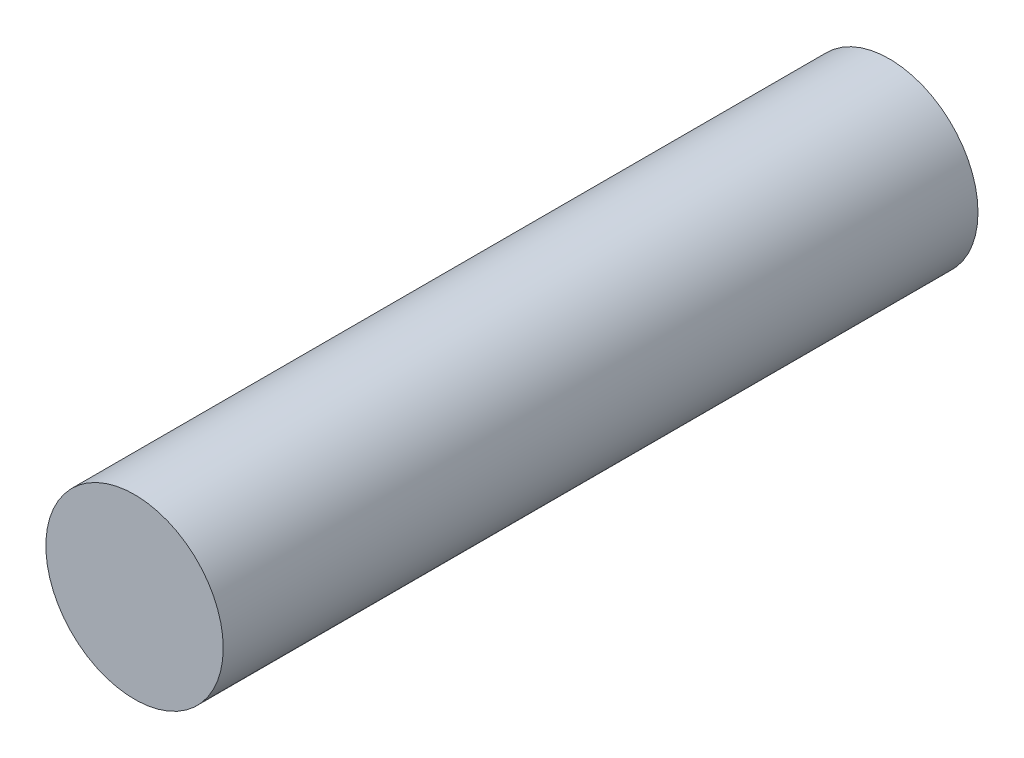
ISO-10303-21;
HEADER;
FILE_DESCRIPTION(('STEP AP214'),'2;1');
FILE_NAME('part.step','',(''),(''),'','','');
FILE_SCHEMA(('AUTOMOTIVE_DESIGN { 1 0 10303 214 1 1 1 1 }'));
ENDSEC;
DATA;
#1=APPLICATION_CONTEXT('core data for automotive mechanical design processes');
#2=APPLICATION_PROTOCOL_DEFINITION('international standard','automotive_design',2000,#1);
#3=PRODUCT_CONTEXT('',#1,'mechanical');
#4=PRODUCT('Part','Part','',(#3));
#5=PRODUCT_RELATED_PRODUCT_CATEGORY('part','',(#4));
#6=PRODUCT_DEFINITION_FORMATION('','',#4);
#7=PRODUCT_DEFINITION_CONTEXT('part definition',#1,'design');
#8=PRODUCT_DEFINITION('design','',#6,#7);
#9=PRODUCT_DEFINITION_SHAPE('','',#8);
#10=(LENGTH_UNIT() NAMED_UNIT(*) SI_UNIT(.MILLI.,.METRE.));
#11=(NAMED_UNIT(*) PLANE_ANGLE_UNIT() SI_UNIT($,.RADIAN.));
#12=(NAMED_UNIT(*) SI_UNIT($,.STERADIAN.) SOLID_ANGLE_UNIT());
#13=UNCERTAINTY_MEASURE_WITH_UNIT(LENGTH_MEASURE(1.E-05),#10,'distance_accuracy_value','');
#14=(GEOMETRIC_REPRESENTATION_CONTEXT(3) GLOBAL_UNCERTAINTY_ASSIGNED_CONTEXT((#13)) GLOBAL_UNIT_ASSIGNED_CONTEXT((#10,
#11,#12)) REPRESENTATION_CONTEXT('',''));
#15=CARTESIAN_POINT('',(0.,0.,0.));
#16=DIRECTION('',(0.,0.,1.));
#17=DIRECTION('',(1.,0.,0.));
#18=AXIS2_PLACEMENT_3D('',#15,#16,#17);
#19=CARTESIAN_POINT('',(0.,0.,5.08));
#20=DIRECTION('',(0.,0.,-1.));
#21=DIRECTION('',(-1.,0.,0.));
#22=AXIS2_PLACEMENT_3D('',#19,#20,#21);
#23=CYLINDRICAL_SURFACE('',#22,1.1938);
#24=CARTESIAN_POINT('',(0.,0.,5.08));
#25=DIRECTION('',(0.,0.,1.));
#26=DIRECTION('',(1.,0.,0.));
#27=AXIS2_PLACEMENT_3D('',#24,#25,#26);
#28=CIRCLE('',#27,1.1938);
#29=CARTESIAN_POINT('',(1.1938,0.,5.08));
#30=VERTEX_POINT('',#29);
#31=EDGE_CURVE('E10',#30,#30,#28,.T.);
#32=ORIENTED_EDGE('',*,*,#31,.F.);
#33=EDGE_LOOP('',(#32));
#34=FACE_BOUND('',#33,.T.);
#35=CARTESIAN_POINT('',(0.,0.,-5.08));
#36=DIRECTION('',(0.,0.,1.));
#37=DIRECTION('',(1.,0.,0.));
#38=AXIS2_PLACEMENT_3D('',#35,#36,#37);
#39=CIRCLE('',#38,1.1938);
#40=CARTESIAN_POINT('',(1.1938,0.,-5.08));
#41=VERTEX_POINT('',#40);
#42=EDGE_CURVE('E34',#41,#41,#39,.T.);
#43=ORIENTED_EDGE('',*,*,#42,.T.);
#44=EDGE_LOOP('',(#43));
#45=FACE_BOUND('',#44,.T.);
#46=ADVANCED_FACE('F31',(#34,#45),#23,.T.);
#47=CARTESIAN_POINT('',(0.,0.,5.08));
#48=DIRECTION('',(0.,0.,1.));
#49=DIRECTION('',(1.,0.,0.));
#50=AXIS2_PLACEMENT_3D('',#47,#48,#49);
#51=PLANE('',#50);
#52=ORIENTED_EDGE('',*,*,#31,.T.);
#53=EDGE_LOOP('',(#52));
#54=FACE_BOUND('',#53,.T.);
#55=ADVANCED_FACE('F46',(#54),#51,.T.);
#56=CARTESIAN_POINT('',(0.,0.,-5.08));
#57=DIRECTION('',(0.,0.,1.));
#58=DIRECTION('',(1.,0.,0.));
#59=AXIS2_PLACEMENT_3D('',#56,#57,#58);
#60=PLANE('',#59);
#61=ORIENTED_EDGE('',*,*,#42,.F.);
#62=EDGE_LOOP('',(#61));
#63=FACE_BOUND('',#62,.T.);
#64=ADVANCED_FACE('F44',(#63),#60,.F.);
#65=CLOSED_SHELL('',(#46,#55,#64));
#66=MANIFOLD_SOLID_BREP('B2',#65);
#67=ADVANCED_BREP_SHAPE_REPRESENTATION('',(#18,#66),#14);
#68=SHAPE_DEFINITION_REPRESENTATION(#9,#67);
ENDSEC;
END-ISO-10303-21;
